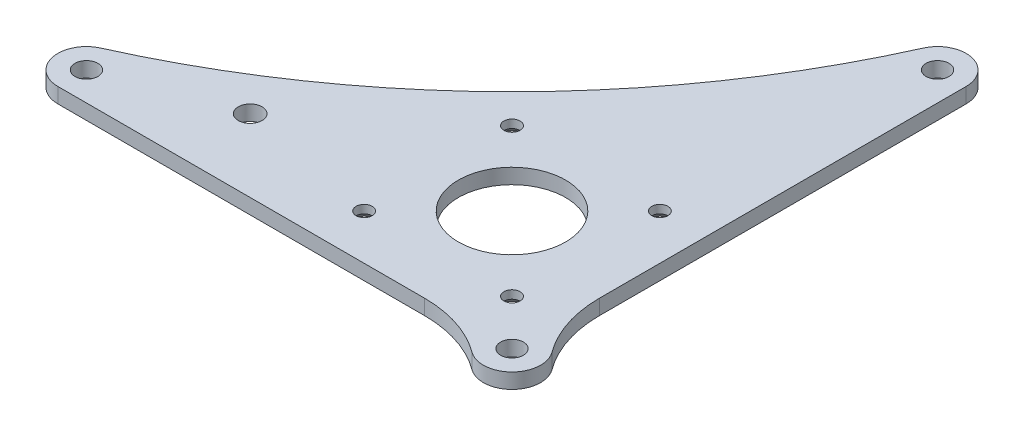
ISO-10303-21;
HEADER;
FILE_DESCRIPTION(('STEP AP214'),'2;1');
FILE_NAME('part.step','',(''),(''),'','','');
FILE_SCHEMA(('AUTOMOTIVE_DESIGN { 1 0 10303 214 1 1 1 1 }'));
ENDSEC;
DATA;
#1=APPLICATION_CONTEXT('core data for automotive mechanical design processes');
#2=APPLICATION_PROTOCOL_DEFINITION('international standard','automotive_design',2000,#1);
#3=PRODUCT_CONTEXT('',#1,'mechanical');
#4=PRODUCT('Part','Part','',(#3));
#5=PRODUCT_RELATED_PRODUCT_CATEGORY('part','',(#4));
#6=PRODUCT_DEFINITION_FORMATION('','',#4);
#7=PRODUCT_DEFINITION_CONTEXT('part definition',#1,'design');
#8=PRODUCT_DEFINITION('design','',#6,#7);
#9=PRODUCT_DEFINITION_SHAPE('','',#8);
#10=(LENGTH_UNIT() NAMED_UNIT(*) SI_UNIT(.MILLI.,.METRE.));
#11=(NAMED_UNIT(*) PLANE_ANGLE_UNIT() SI_UNIT($,.RADIAN.));
#12=(NAMED_UNIT(*) SI_UNIT($,.STERADIAN.) SOLID_ANGLE_UNIT());
#13=UNCERTAINTY_MEASURE_WITH_UNIT(LENGTH_MEASURE(1.E-05),#10,'distance_accuracy_value','');
#14=(GEOMETRIC_REPRESENTATION_CONTEXT(3) GLOBAL_UNCERTAINTY_ASSIGNED_CONTEXT((#13)) GLOBAL_UNIT_ASSIGNED_CONTEXT((#10,
#11,#12)) REPRESENTATION_CONTEXT('',''));
#15=CARTESIAN_POINT('',(0.,0.,0.));
#16=DIRECTION('',(0.,0.,1.));
#17=DIRECTION('',(1.,0.,0.));
#18=AXIS2_PLACEMENT_3D('',#15,#16,#17);
#19=CARTESIAN_POINT('',(-6.,0.,-95.25));
#20=DIRECTION('',(0.,-1.,0.));
#21=DIRECTION('',(0.,0.,-1.));
#22=AXIS2_PLACEMENT_3D('',#19,#20,#21);
#23=PLANE('',#22);
#24=CARTESIAN_POINT('',(-70.1317294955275,0.,-15.2236095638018));
#25=DIRECTION('',(0.,1.,0.));
#26=DIRECTION('',(0.,0.,1.));
#27=AXIS2_PLACEMENT_3D('',#24,#25,#26);
#28=CIRCLE('',#27,2.5);
#29=CARTESIAN_POINT('',(-70.1317294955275,0.,-12.7236095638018));
#30=VERTEX_POINT('',#29);
#31=EDGE_CURVE('E273',#30,#30,#28,.T.);
#32=ORIENTED_EDGE('',*,*,#31,.F.);
#33=EDGE_LOOP('',(#32));
#34=FACE_BOUND('',#33,.T.);
#35=CARTESIAN_POINT('',(-9.5,0.,-9.50000000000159));
#36=DIRECTION('',(0.,-1.,0.));
#37=DIRECTION('',(0.,0.,-1.));
#38=AXIS2_PLACEMENT_3D('',#35,#36,#37);
#39=CIRCLE('',#38,1.7);
#40=CARTESIAN_POINT('',(-9.5,0.,-11.2000000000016));
#41=VERTEX_POINT('',#40);
#42=EDGE_CURVE('E285',#41,#41,#39,.T.);
#43=ORIENTED_EDGE('',*,*,#42,.T.);
#44=EDGE_LOOP('',(#43));
#45=FACE_BOUND('',#44,.T.);
#46=CARTESIAN_POINT('',(-40.5,0.,-40.5000000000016));
#47=DIRECTION('',(0.,-1.,0.));
#48=DIRECTION('',(0.,0.,-1.));
#49=AXIS2_PLACEMENT_3D('',#46,#47,#48);
#50=CIRCLE('',#49,1.7);
#51=CARTESIAN_POINT('',(-40.5,0.,-42.2000000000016));
#52=VERTEX_POINT('',#51);
#53=EDGE_CURVE('E294',#52,#52,#50,.T.);
#54=ORIENTED_EDGE('',*,*,#53,.T.);
#55=EDGE_LOOP('',(#54));
#56=FACE_BOUND('',#55,.T.);
#57=CARTESIAN_POINT('',(-40.5,0.,-9.50000000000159));
#58=DIRECTION('',(0.,-1.,0.));
#59=DIRECTION('',(0.,0.,-1.));
#60=AXIS2_PLACEMENT_3D('',#57,#58,#59);
#61=CIRCLE('',#60,1.7);
#62=CARTESIAN_POINT('',(-40.5,0.,-11.2000000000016));
#63=VERTEX_POINT('',#62);
#64=EDGE_CURVE('E303',#63,#63,#61,.T.);
#65=ORIENTED_EDGE('',*,*,#64,.T.);
#66=EDGE_LOOP('',(#65));
#67=FACE_BOUND('',#66,.T.);
#68=CARTESIAN_POINT('',(-9.50000000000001,0.,-40.5000000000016));
#69=DIRECTION('',(0.,-1.,0.));
#70=DIRECTION('',(0.,0.,-1.));
#71=AXIS2_PLACEMENT_3D('',#68,#69,#70);
#72=CIRCLE('',#71,1.7);
#73=CARTESIAN_POINT('',(-9.50000000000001,0.,-42.2000000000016));
#74=VERTEX_POINT('',#73);
#75=EDGE_CURVE('E312',#74,#74,#72,.T.);
#76=ORIENTED_EDGE('',*,*,#75,.T.);
#77=EDGE_LOOP('',(#76));
#78=FACE_BOUND('',#77,.T.);
#79=CARTESIAN_POINT('',(-25.,0.,-25.0000000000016));
#80=DIRECTION('',(0.,1.,0.));
#81=DIRECTION('',(0.,0.,1.));
#82=AXIS2_PLACEMENT_3D('',#79,#80,#81);
#83=CIRCLE('',#82,11.25);
#84=CARTESIAN_POINT('',(-25.,0.,-13.7500000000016));
#85=VERTEX_POINT('',#84);
#86=EDGE_CURVE('E315',#85,#85,#83,.T.);
#87=ORIENTED_EDGE('',*,*,#86,.F.);
#88=EDGE_LOOP('',(#87));
#89=FACE_BOUND('',#88,.T.);
#90=CARTESIAN_POINT('',(-6.,0.,-95.25));
#91=DIRECTION('',(0.,1.,0.));
#92=DIRECTION('',(0.,0.,-1.));
#93=AXIS2_PLACEMENT_3D('',#90,#91,#92);
#94=CIRCLE('',#93,6.00000000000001);
#95=CARTESIAN_POINT('',(0.,0.,-95.25));
#96=VERTEX_POINT('',#95);
#97=CARTESIAN_POINT('',(-11.4745125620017,0.,-97.7055472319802));
#98=VERTEX_POINT('',#97);
#99=EDGE_CURVE('E145',#96,#98,#94,.T.);
#100=ORIENTED_EDGE('',*,*,#99,.T.);
#101=CARTESIAN_POINT('',(-167.843609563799,0.,-167.8436095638));
#102=DIRECTION('',(0.,-1.,0.));
#103=DIRECTION('',(0.,0.,1.));
#104=AXIS2_PLACEMENT_3D('',#101,#102,#103);
#105=CIRCLE('',#104,171.37865177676);
#106=CARTESIAN_POINT('',(-97.7055472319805,0.,-11.4745125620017));
#107=VERTEX_POINT('',#106);
#108=EDGE_CURVE('E148',#98,#107,#105,.T.);
#109=ORIENTED_EDGE('',*,*,#108,.T.);
#110=CARTESIAN_POINT('',(-95.2500000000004,0.,-5.99999999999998));
#111=DIRECTION('',(0.,1.,0.));
#112=DIRECTION('',(0.,0.,1.));
#113=AXIS2_PLACEMENT_3D('',#110,#111,#112);
#114=CIRCLE('',#113,6.00000000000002);
#115=CARTESIAN_POINT('',(-95.2500000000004,0.,0.));
#116=VERTEX_POINT('',#115);
#117=EDGE_CURVE('E152',#107,#116,#114,.T.);
#118=ORIENTED_EDGE('',*,*,#117,.T.);
#119=DIRECTION('',(1.,0.,0.));
#120=VECTOR('',#119,1.);
#121=CARTESIAN_POINT('',(-18.3303027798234,0.,0.));
#122=LINE('',#121,#120);
#123=CARTESIAN_POINT('',(-18.3303027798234,0.,0.));
#124=VERTEX_POINT('',#123);
#125=EDGE_CURVE('E155',#116,#124,#122,.T.);
#126=ORIENTED_EDGE('',*,*,#125,.T.);
#127=CARTESIAN_POINT('',(-18.3303027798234,0.,25.));
#128=DIRECTION('',(0.,-1.,0.));
#129=DIRECTION('',(0.,0.,1.));
#130=AXIS2_PLACEMENT_3D('',#127,#128,#129);
#131=CIRCLE('',#130,25.);
#132=CARTESIAN_POINT('',(-3.54780053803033,0.,4.83870967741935));
#133=VERTEX_POINT('',#132);
#134=EDGE_CURVE('E158',#124,#133,#131,.T.);
#135=ORIENTED_EDGE('',*,*,#134,.T.);
#136=CARTESIAN_POINT('',(0.,0.,0.));
#137=DIRECTION('',(0.,1.,0.));
#138=DIRECTION('',(0.,0.,1.));
#139=AXIS2_PLACEMENT_3D('',#136,#137,#138);
#140=CIRCLE('',#139,6.);
#141=CARTESIAN_POINT('',(4.83870967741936,0.,-3.54780053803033));
#142=VERTEX_POINT('',#141);
#143=EDGE_CURVE('E161',#133,#142,#140,.T.);
#144=ORIENTED_EDGE('',*,*,#143,.T.);
#145=CARTESIAN_POINT('',(25.,0.,-18.3303027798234));
#146=DIRECTION('',(0.,-1.,0.));
#147=DIRECTION('',(0.,0.,-1.));
#148=AXIS2_PLACEMENT_3D('',#145,#146,#147);
#149=CIRCLE('',#148,25.);
#150=CARTESIAN_POINT('',(0.,0.,-18.3303027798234));
#151=VERTEX_POINT('',#150);
#152=EDGE_CURVE('E122',#142,#151,#149,.T.);
#153=ORIENTED_EDGE('',*,*,#152,.T.);
#154=DIRECTION('',(0.,0.,-1.));
#155=VECTOR('',#154,1.);
#156=CARTESIAN_POINT('',(0.,0.,-18.3303027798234));
#157=LINE('',#156,#155);
#158=EDGE_CURVE('E164',#151,#96,#157,.T.);
#159=ORIENTED_EDGE('',*,*,#158,.T.);
#160=EDGE_LOOP('',(#100,#109,#118,#126,#135,#144,#153,#159));
#161=FACE_BOUND('',#160,.T.);
#162=CARTESIAN_POINT('',(0.,0.,0.));
#163=DIRECTION('',(0.,1.,0.));
#164=DIRECTION('',(0.,0.,1.));
#165=AXIS2_PLACEMENT_3D('',#162,#163,#164);
#166=CIRCLE('',#165,2.4);
#167=CARTESIAN_POINT('',(0.,0.,2.4));
#168=VERTEX_POINT('',#167);
#169=EDGE_CURVE('E267',#168,#168,#166,.T.);
#170=ORIENTED_EDGE('',*,*,#169,.F.);
#171=EDGE_LOOP('',(#170));
#172=FACE_BOUND('',#171,.T.);
#173=CARTESIAN_POINT('',(-6.,0.,-95.25));
#174=DIRECTION('',(0.,1.,0.));
#175=DIRECTION('',(0.,0.,1.));
#176=AXIS2_PLACEMENT_3D('',#173,#174,#175);
#177=CIRCLE('',#176,2.4);
#178=CARTESIAN_POINT('',(-6.,0.,-92.85));
#179=VERTEX_POINT('',#178);
#180=EDGE_CURVE('E258',#179,#179,#177,.T.);
#181=ORIENTED_EDGE('',*,*,#180,.F.);
#182=EDGE_LOOP('',(#181));
#183=FACE_BOUND('',#182,.T.);
#184=CARTESIAN_POINT('',(-95.2500000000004,0.,-5.99999999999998));
#185=DIRECTION('',(0.,1.,0.));
#186=DIRECTION('',(0.,0.,1.));
#187=AXIS2_PLACEMENT_3D('',#184,#185,#186);
#188=CIRCLE('',#187,2.4);
#189=CARTESIAN_POINT('',(-95.2500000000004,0.,-3.59999999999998));
#190=VERTEX_POINT('',#189);
#191=EDGE_CURVE('E254',#190,#190,#188,.T.);
#192=ORIENTED_EDGE('',*,*,#191,.F.);
#193=EDGE_LOOP('',(#192));
#194=FACE_BOUND('',#193,.T.);
#195=ADVANCED_FACE('F47',(#34,#45,#56,#67,#78,#89,#161,#172,#183,#194),#23,.F.);
#196=CARTESIAN_POINT('',(-6.,-3.175,-95.25));
#197=DIRECTION('',(0.,1.,0.));
#198=DIRECTION('',(0.,0.,1.));
#199=AXIS2_PLACEMENT_3D('',#196,#197,#198);
#200=CYLINDRICAL_SURFACE('',#199,6.00000000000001);
#201=ORIENTED_EDGE('',*,*,#99,.F.);
#202=DIRECTION('',(0.,1.,0.));
#203=VECTOR('',#202,1.);
#204=CARTESIAN_POINT('',(0.,-3.175,-95.25));
#205=LINE('',#204,#203);
#206=CARTESIAN_POINT('',(0.,-3.175,-95.25));
#207=VERTEX_POINT('',#206);
#208=EDGE_CURVE('E11',#207,#96,#205,.T.);
#209=ORIENTED_EDGE('',*,*,#208,.F.);
#210=CARTESIAN_POINT('',(-6.,-3.175,-95.25));
#211=DIRECTION('',(0.,1.,0.));
#212=DIRECTION('',(0.,0.,-1.));
#213=AXIS2_PLACEMENT_3D('',#210,#211,#212);
#214=CIRCLE('',#213,6.00000000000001);
#215=CARTESIAN_POINT('',(-11.4745125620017,-3.175,-97.7055472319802));
#216=VERTEX_POINT('',#215);
#217=EDGE_CURVE('E166',#207,#216,#214,.T.);
#218=ORIENTED_EDGE('',*,*,#217,.T.);
#219=DIRECTION('',(0.,1.,0.));
#220=VECTOR('',#219,1.);
#221=CARTESIAN_POINT('',(-11.4745125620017,-3.175,-97.7055472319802));
#222=LINE('',#221,#220);
#223=EDGE_CURVE('E51',#216,#98,#222,.T.);
#224=ORIENTED_EDGE('',*,*,#223,.T.);
#225=EDGE_LOOP('',(#201,#209,#218,#224));
#226=FACE_BOUND('',#225,.T.);
#227=ADVANCED_FACE('F49',(#226),#200,.T.);
#228=CARTESIAN_POINT('',(0.,-3.175,-18.3303027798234));
#229=DIRECTION('',(1.,0.,0.));
#230=DIRECTION('',(0.,0.,-1.));
#231=AXIS2_PLACEMENT_3D('',#228,#229,#230);
#232=PLANE('',#231);
#233=ORIENTED_EDGE('',*,*,#158,.F.);
#234=DIRECTION('',(0.,1.,0.));
#235=VECTOR('',#234,1.);
#236=CARTESIAN_POINT('',(0.,-3.175,-18.3303027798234));
#237=LINE('',#236,#235);
#238=CARTESIAN_POINT('',(0.,-3.175,-18.3303027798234));
#239=VERTEX_POINT('',#238);
#240=EDGE_CURVE('E57',#239,#151,#237,.T.);
#241=ORIENTED_EDGE('',*,*,#240,.F.);
#242=DIRECTION('',(0.,0.,-1.));
#243=VECTOR('',#242,1.);
#244=CARTESIAN_POINT('',(0.,-3.175,-18.3303027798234));
#245=LINE('',#244,#243);
#246=EDGE_CURVE('E135',#239,#207,#245,.T.);
#247=ORIENTED_EDGE('',*,*,#246,.T.);
#248=ORIENTED_EDGE('',*,*,#208,.T.);
#249=EDGE_LOOP('',(#233,#241,#247,#248));
#250=FACE_BOUND('',#249,.T.);
#251=ADVANCED_FACE('F178',(#250),#232,.T.);
#252=CARTESIAN_POINT('',(25.,-3.175,-18.3303027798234));
#253=DIRECTION('',(0.,1.,0.));
#254=DIRECTION('',(0.,0.,1.));
#255=AXIS2_PLACEMENT_3D('',#252,#253,#254);
#256=CYLINDRICAL_SURFACE('',#255,25.);
#257=ORIENTED_EDGE('',*,*,#152,.F.);
#258=DIRECTION('',(0.,1.,0.));
#259=VECTOR('',#258,1.);
#260=CARTESIAN_POINT('',(4.83870967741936,-3.175,-3.54780053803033));
#261=LINE('',#260,#259);
#262=CARTESIAN_POINT('',(4.83870967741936,-3.175,-3.54780053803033));
#263=VERTEX_POINT('',#262);
#264=EDGE_CURVE('E117',#263,#142,#261,.T.);
#265=ORIENTED_EDGE('',*,*,#264,.F.);
#266=CARTESIAN_POINT('',(25.,-3.175,-18.3303027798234));
#267=DIRECTION('',(0.,-1.,0.));
#268=DIRECTION('',(0.,0.,-1.));
#269=AXIS2_PLACEMENT_3D('',#266,#267,#268);
#270=CIRCLE('',#269,25.);
#271=EDGE_CURVE('E120',#263,#239,#270,.T.);
#272=ORIENTED_EDGE('',*,*,#271,.T.);
#273=ORIENTED_EDGE('',*,*,#240,.T.);
#274=EDGE_LOOP('',(#257,#265,#272,#273));
#275=FACE_BOUND('',#274,.T.);
#276=ADVANCED_FACE('F119',(#275),#256,.F.);
#277=CARTESIAN_POINT('',(0.,-3.175,0.));
#278=DIRECTION('',(0.,1.,0.));
#279=DIRECTION('',(0.,0.,1.));
#280=AXIS2_PLACEMENT_3D('',#277,#278,#279);
#281=CYLINDRICAL_SURFACE('',#280,6.);
#282=ORIENTED_EDGE('',*,*,#143,.F.);
#283=DIRECTION('',(0.,1.,0.));
#284=VECTOR('',#283,1.);
#285=CARTESIAN_POINT('',(-3.54780053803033,-3.175,4.83870967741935));
#286=LINE('',#285,#284);
#287=CARTESIAN_POINT('',(-3.54780053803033,-3.175,4.83870967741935));
#288=VERTEX_POINT('',#287);
#289=EDGE_CURVE('E127',#288,#133,#286,.T.);
#290=ORIENTED_EDGE('',*,*,#289,.F.);
#291=CARTESIAN_POINT('',(0.,-3.175,0.));
#292=DIRECTION('',(0.,1.,0.));
#293=DIRECTION('',(0.,0.,1.));
#294=AXIS2_PLACEMENT_3D('',#291,#292,#293);
#295=CIRCLE('',#294,6.);
#296=EDGE_CURVE('E133',#288,#263,#295,.T.);
#297=ORIENTED_EDGE('',*,*,#296,.T.);
#298=ORIENTED_EDGE('',*,*,#264,.T.);
#299=EDGE_LOOP('',(#282,#290,#297,#298));
#300=FACE_BOUND('',#299,.T.);
#301=ADVANCED_FACE('F137',(#300),#281,.T.);
#302=CARTESIAN_POINT('',(-18.3303027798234,-3.175,25.));
#303=DIRECTION('',(0.,1.,0.));
#304=DIRECTION('',(0.,0.,1.));
#305=AXIS2_PLACEMENT_3D('',#302,#303,#304);
#306=CYLINDRICAL_SURFACE('',#305,25.);
#307=ORIENTED_EDGE('',*,*,#134,.F.);
#308=DIRECTION('',(0.,1.,0.));
#309=VECTOR('',#308,1.);
#310=CARTESIAN_POINT('',(-18.3303027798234,-3.175,0.));
#311=LINE('',#310,#309);
#312=CARTESIAN_POINT('',(-18.3303027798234,-3.175,0.));
#313=VERTEX_POINT('',#312);
#314=EDGE_CURVE('E170',#313,#124,#311,.T.);
#315=ORIENTED_EDGE('',*,*,#314,.F.);
#316=CARTESIAN_POINT('',(-18.3303027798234,-3.175,25.));
#317=DIRECTION('',(0.,-1.,0.));
#318=DIRECTION('',(0.,0.,1.));
#319=AXIS2_PLACEMENT_3D('',#316,#317,#318);
#320=CIRCLE('',#319,25.);
#321=EDGE_CURVE('E138',#313,#288,#320,.T.);
#322=ORIENTED_EDGE('',*,*,#321,.T.);
#323=ORIENTED_EDGE('',*,*,#289,.T.);
#324=EDGE_LOOP('',(#307,#315,#322,#323));
#325=FACE_BOUND('',#324,.T.);
#326=ADVANCED_FACE('F335',(#325),#306,.F.);
#327=CARTESIAN_POINT('',(-18.3303027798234,-3.175,0.));
#328=DIRECTION('',(0.,0.,1.));
#329=DIRECTION('',(1.,0.,0.));
#330=AXIS2_PLACEMENT_3D('',#327,#328,#329);
#331=PLANE('',#330);
#332=ORIENTED_EDGE('',*,*,#125,.F.);
#333=DIRECTION('',(0.,1.,0.));
#334=VECTOR('',#333,1.);
#335=CARTESIAN_POINT('',(-95.2500000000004,-3.175,0.));
#336=LINE('',#335,#334);
#337=CARTESIAN_POINT('',(-95.2500000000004,-3.175,0.));
#338=VERTEX_POINT('',#337);
#339=EDGE_CURVE('E172',#338,#116,#336,.T.);
#340=ORIENTED_EDGE('',*,*,#339,.F.);
#341=DIRECTION('',(1.,0.,0.));
#342=VECTOR('',#341,1.);
#343=CARTESIAN_POINT('',(-18.3303027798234,-3.175,0.));
#344=LINE('',#343,#342);
#345=EDGE_CURVE('E140',#338,#313,#344,.T.);
#346=ORIENTED_EDGE('',*,*,#345,.T.);
#347=ORIENTED_EDGE('',*,*,#314,.T.);
#348=EDGE_LOOP('',(#332,#340,#346,#347));
#349=FACE_BOUND('',#348,.T.);
#350=ADVANCED_FACE('F329',(#349),#331,.T.);
#351=CARTESIAN_POINT('',(-95.2500000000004,-3.175,-5.99999999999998));
#352=DIRECTION('',(0.,1.,0.));
#353=DIRECTION('',(0.,0.,1.));
#354=AXIS2_PLACEMENT_3D('',#351,#352,#353);
#355=CYLINDRICAL_SURFACE('',#354,6.00000000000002);
#356=ORIENTED_EDGE('',*,*,#117,.F.);
#357=DIRECTION('',(0.,1.,0.));
#358=VECTOR('',#357,1.);
#359=CARTESIAN_POINT('',(-97.7055472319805,-3.175,-11.4745125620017));
#360=LINE('',#359,#358);
#361=CARTESIAN_POINT('',(-97.7055472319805,-3.175,-11.4745125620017));
#362=VERTEX_POINT('',#361);
#363=EDGE_CURVE('E173',#362,#107,#360,.T.);
#364=ORIENTED_EDGE('',*,*,#363,.F.);
#365=CARTESIAN_POINT('',(-95.2500000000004,-3.175,-5.99999999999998));
#366=DIRECTION('',(0.,1.,0.));
#367=DIRECTION('',(0.,0.,1.));
#368=AXIS2_PLACEMENT_3D('',#365,#366,#367);
#369=CIRCLE('',#368,6.00000000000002);
#370=EDGE_CURVE('E323',#362,#338,#369,.T.);
#371=ORIENTED_EDGE('',*,*,#370,.T.);
#372=ORIENTED_EDGE('',*,*,#339,.T.);
#373=EDGE_LOOP('',(#356,#364,#371,#372));
#374=FACE_BOUND('',#373,.T.);
#375=ADVANCED_FACE('F333',(#374),#355,.T.);
#376=CARTESIAN_POINT('',(-167.843609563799,-3.175,-167.8436095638));
#377=DIRECTION('',(0.,1.,0.));
#378=DIRECTION('',(0.,0.,1.));
#379=AXIS2_PLACEMENT_3D('',#376,#377,#378);
#380=CYLINDRICAL_SURFACE('',#379,171.37865177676);
#381=ORIENTED_EDGE('',*,*,#108,.F.);
#382=ORIENTED_EDGE('',*,*,#223,.F.);
#383=CARTESIAN_POINT('',(-167.843609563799,-3.175,-167.8436095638));
#384=DIRECTION('',(0.,-1.,0.));
#385=DIRECTION('',(0.,0.,1.));
#386=AXIS2_PLACEMENT_3D('',#383,#384,#385);
#387=CIRCLE('',#386,171.37865177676);
#388=EDGE_CURVE('E321',#216,#362,#387,.T.);
#389=ORIENTED_EDGE('',*,*,#388,.T.);
#390=ORIENTED_EDGE('',*,*,#363,.T.);
#391=EDGE_LOOP('',(#381,#382,#389,#390));
#392=FACE_BOUND('',#391,.T.);
#393=ADVANCED_FACE('F175',(#392),#380,.F.);
#394=CARTESIAN_POINT('',(-6.,-3.175,-95.25));
#395=DIRECTION('',(0.,-1.,0.));
#396=DIRECTION('',(0.,0.,-1.));
#397=AXIS2_PLACEMENT_3D('',#394,#395,#396);
#398=PLANE('',#397);
#399=CARTESIAN_POINT('',(-95.2500000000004,-3.175,-5.99999999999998));
#400=DIRECTION('',(0.,-1.,0.));
#401=DIRECTION('',(0.,0.,-1.));
#402=AXIS2_PLACEMENT_3D('',#399,#400,#401);
#403=CIRCLE('',#402,2.4);
#404=CARTESIAN_POINT('',(-95.2500000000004,-3.175,-8.39999999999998));
#405=VERTEX_POINT('',#404);
#406=EDGE_CURVE('E257',#405,#405,#403,.T.);
#407=ORIENTED_EDGE('',*,*,#406,.F.);
#408=EDGE_LOOP('',(#407));
#409=FACE_BOUND('',#408,.T.);
#410=CARTESIAN_POINT('',(-6.,-3.175,-95.25));
#411=DIRECTION('',(0.,-1.,0.));
#412=DIRECTION('',(0.,0.,-1.));
#413=AXIS2_PLACEMENT_3D('',#410,#411,#412);
#414=CIRCLE('',#413,2.4);
#415=CARTESIAN_POINT('',(-6.,-3.175,-97.65));
#416=VERTEX_POINT('',#415);
#417=EDGE_CURVE('E261',#416,#416,#414,.T.);
#418=ORIENTED_EDGE('',*,*,#417,.F.);
#419=EDGE_LOOP('',(#418));
#420=FACE_BOUND('',#419,.T.);
#421=CARTESIAN_POINT('',(0.,-3.175,0.));
#422=DIRECTION('',(0.,-1.,0.));
#423=DIRECTION('',(0.,0.,-1.));
#424=AXIS2_PLACEMENT_3D('',#421,#422,#423);
#425=CIRCLE('',#424,2.4);
#426=CARTESIAN_POINT('',(0.,-3.175,-2.4));
#427=VERTEX_POINT('',#426);
#428=EDGE_CURVE('E270',#427,#427,#425,.T.);
#429=ORIENTED_EDGE('',*,*,#428,.F.);
#430=EDGE_LOOP('',(#429));
#431=FACE_BOUND('',#430,.T.);
#432=CARTESIAN_POINT('',(-70.1317294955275,-3.175,-15.2236095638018));
#433=DIRECTION('',(0.,-1.,0.));
#434=DIRECTION('',(0.,0.,-1.));
#435=AXIS2_PLACEMENT_3D('',#432,#433,#434);
#436=CIRCLE('',#435,2.5);
#437=CARTESIAN_POINT('',(-70.1317294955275,-3.175,-17.7236095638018));
#438=VERTEX_POINT('',#437);
#439=EDGE_CURVE('E276',#438,#438,#436,.T.);
#440=ORIENTED_EDGE('',*,*,#439,.F.);
#441=EDGE_LOOP('',(#440));
#442=FACE_BOUND('',#441,.T.);
#443=CARTESIAN_POINT('',(-9.5,-3.175,-9.50000000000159));
#444=DIRECTION('',(0.,-1.,0.));
#445=DIRECTION('',(0.,0.,-1.));
#446=AXIS2_PLACEMENT_3D('',#443,#444,#445);
#447=CIRCLE('',#446,3.15);
#448=CARTESIAN_POINT('',(-9.5,-3.175,-12.6500000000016));
#449=VERTEX_POINT('',#448);
#450=EDGE_CURVE('E279',#449,#449,#447,.T.);
#451=ORIENTED_EDGE('',*,*,#450,.F.);
#452=EDGE_LOOP('',(#451));
#453=FACE_BOUND('',#452,.T.);
#454=CARTESIAN_POINT('',(-40.5,-3.175,-40.5000000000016));
#455=DIRECTION('',(0.,-1.,0.));
#456=DIRECTION('',(0.,0.,-1.));
#457=AXIS2_PLACEMENT_3D('',#454,#455,#456);
#458=CIRCLE('',#457,3.15);
#459=CARTESIAN_POINT('',(-40.5,-3.175,-43.6500000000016));
#460=VERTEX_POINT('',#459);
#461=EDGE_CURVE('E288',#460,#460,#458,.T.);
#462=ORIENTED_EDGE('',*,*,#461,.F.);
#463=EDGE_LOOP('',(#462));
#464=FACE_BOUND('',#463,.T.);
#465=CARTESIAN_POINT('',(-40.5,-3.175,-9.50000000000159));
#466=DIRECTION('',(0.,-1.,0.));
#467=DIRECTION('',(0.,0.,-1.));
#468=AXIS2_PLACEMENT_3D('',#465,#466,#467);
#469=CIRCLE('',#468,3.15);
#470=CARTESIAN_POINT('',(-40.5,-3.175,-12.6500000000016));
#471=VERTEX_POINT('',#470);
#472=EDGE_CURVE('E297',#471,#471,#469,.T.);
#473=ORIENTED_EDGE('',*,*,#472,.F.);
#474=EDGE_LOOP('',(#473));
#475=FACE_BOUND('',#474,.T.);
#476=CARTESIAN_POINT('',(-9.50000000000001,-3.175,-40.5000000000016));
#477=DIRECTION('',(0.,-1.,0.));
#478=DIRECTION('',(0.,0.,-1.));
#479=AXIS2_PLACEMENT_3D('',#476,#477,#478);
#480=CIRCLE('',#479,3.15);
#481=CARTESIAN_POINT('',(-9.50000000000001,-3.175,-43.6500000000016));
#482=VERTEX_POINT('',#481);
#483=EDGE_CURVE('E306',#482,#482,#480,.T.);
#484=ORIENTED_EDGE('',*,*,#483,.F.);
#485=EDGE_LOOP('',(#484));
#486=FACE_BOUND('',#485,.T.);
#487=CARTESIAN_POINT('',(-25.,-3.175,-25.0000000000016));
#488=DIRECTION('',(0.,1.,0.));
#489=DIRECTION('',(0.,0.,1.));
#490=AXIS2_PLACEMENT_3D('',#487,#488,#489);
#491=CIRCLE('',#490,11.25);
#492=CARTESIAN_POINT('',(-25.,-3.175,-13.7500000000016));
#493=VERTEX_POINT('',#492);
#494=EDGE_CURVE('E149',#493,#493,#491,.T.);
#495=ORIENTED_EDGE('',*,*,#494,.T.);
#496=EDGE_LOOP('',(#495));
#497=FACE_BOUND('',#496,.T.);
#498=ORIENTED_EDGE('',*,*,#217,.F.);
#499=ORIENTED_EDGE('',*,*,#246,.F.);
#500=ORIENTED_EDGE('',*,*,#271,.F.);
#501=ORIENTED_EDGE('',*,*,#296,.F.);
#502=ORIENTED_EDGE('',*,*,#321,.F.);
#503=ORIENTED_EDGE('',*,*,#345,.F.);
#504=ORIENTED_EDGE('',*,*,#370,.F.);
#505=ORIENTED_EDGE('',*,*,#388,.F.);
#506=EDGE_LOOP('',(#498,#499,#500,#501,#502,#503,#504,#505));
#507=FACE_BOUND('',#506,.T.);
#508=ADVANCED_FACE('F131',(#409,#420,#431,#442,#453,#464,#475,#486,#497,#507),#398,.T.);
#509=CARTESIAN_POINT('',(-25.,-3.175,-25.0000000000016));
#510=DIRECTION('',(0.,1.,0.));
#511=DIRECTION('',(0.,0.,1.));
#512=AXIS2_PLACEMENT_3D('',#509,#510,#511);
#513=CYLINDRICAL_SURFACE('',#512,11.25);
#514=ORIENTED_EDGE('',*,*,#494,.F.);
#515=EDGE_LOOP('',(#514));
#516=FACE_BOUND('',#515,.T.);
#517=ORIENTED_EDGE('',*,*,#86,.T.);
#518=EDGE_LOOP('',(#517));
#519=FACE_BOUND('',#518,.T.);
#520=ADVANCED_FACE('F197',(#516,#519),#513,.F.);
#521=CARTESIAN_POINT('',(-9.50000000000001,-3.175,-40.5000000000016));
#522=DIRECTION('',(0.,-1.,0.));
#523=DIRECTION('',(0.,0.,-1.));
#524=AXIS2_PLACEMENT_3D('',#521,#522,#523);
#525=CYLINDRICAL_SURFACE('',#524,1.7);
#526=ORIENTED_EDGE('',*,*,#75,.F.);
#527=EDGE_LOOP('',(#526));
#528=FACE_BOUND('',#527,.T.);
#529=CARTESIAN_POINT('',(-9.50000000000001,-1.725,-40.5000000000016));
#530=DIRECTION('',(0.,-1.,0.));
#531=DIRECTION('',(0.,0.,-1.));
#532=AXIS2_PLACEMENT_3D('',#529,#530,#531);
#533=CIRCLE('',#532,1.7);
#534=CARTESIAN_POINT('',(-9.50000000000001,-1.725,-42.2000000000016));
#535=VERTEX_POINT('',#534);
#536=EDGE_CURVE('E309',#535,#535,#533,.T.);
#537=ORIENTED_EDGE('',*,*,#536,.T.);
#538=EDGE_LOOP('',(#537));
#539=FACE_BOUND('',#538,.T.);
#540=ADVANCED_FACE('F201',(#528,#539),#525,.F.);
#541=CARTESIAN_POINT('',(-9.50000000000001,-3.175,-40.5000000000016));
#542=DIRECTION('',(0.,-1.,0.));
#543=DIRECTION('',(0.,0.,-1.));
#544=AXIS2_PLACEMENT_3D('',#541,#542,#543);
#545=CONICAL_SURFACE('',#544,3.15,0.785398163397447);
#546=ORIENTED_EDGE('',*,*,#536,.F.);
#547=EDGE_LOOP('',(#546));
#548=FACE_BOUND('',#547,.T.);
#549=ORIENTED_EDGE('',*,*,#483,.T.);
#550=EDGE_LOOP('',(#549));
#551=FACE_BOUND('',#550,.T.);
#552=ADVANCED_FACE('F205',(#548,#551),#545,.F.);
#553=CARTESIAN_POINT('',(-40.5,-3.175,-9.50000000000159));
#554=DIRECTION('',(0.,-1.,0.));
#555=DIRECTION('',(0.,0.,-1.));
#556=AXIS2_PLACEMENT_3D('',#553,#554,#555);
#557=CYLINDRICAL_SURFACE('',#556,1.7);
#558=ORIENTED_EDGE('',*,*,#64,.F.);
#559=EDGE_LOOP('',(#558));
#560=FACE_BOUND('',#559,.T.);
#561=CARTESIAN_POINT('',(-40.5,-1.725,-9.50000000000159));
#562=DIRECTION('',(0.,-1.,0.));
#563=DIRECTION('',(0.,0.,-1.));
#564=AXIS2_PLACEMENT_3D('',#561,#562,#563);
#565=CIRCLE('',#564,1.7);
#566=CARTESIAN_POINT('',(-40.5,-1.725,-11.2000000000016));
#567=VERTEX_POINT('',#566);
#568=EDGE_CURVE('E300',#567,#567,#565,.T.);
#569=ORIENTED_EDGE('',*,*,#568,.T.);
#570=EDGE_LOOP('',(#569));
#571=FACE_BOUND('',#570,.T.);
#572=ADVANCED_FACE('F209',(#560,#571),#557,.F.);
#573=CARTESIAN_POINT('',(-40.5,-3.175,-9.50000000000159));
#574=DIRECTION('',(0.,-1.,0.));
#575=DIRECTION('',(0.,0.,-1.));
#576=AXIS2_PLACEMENT_3D('',#573,#574,#575);
#577=CONICAL_SURFACE('',#576,3.15,0.785398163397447);
#578=ORIENTED_EDGE('',*,*,#568,.F.);
#579=EDGE_LOOP('',(#578));
#580=FACE_BOUND('',#579,.T.);
#581=ORIENTED_EDGE('',*,*,#472,.T.);
#582=EDGE_LOOP('',(#581));
#583=FACE_BOUND('',#582,.T.);
#584=ADVANCED_FACE('F213',(#580,#583),#577,.F.);
#585=CARTESIAN_POINT('',(-40.5,-3.175,-40.5000000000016));
#586=DIRECTION('',(0.,-1.,0.));
#587=DIRECTION('',(0.,0.,-1.));
#588=AXIS2_PLACEMENT_3D('',#585,#586,#587);
#589=CYLINDRICAL_SURFACE('',#588,1.7);
#590=ORIENTED_EDGE('',*,*,#53,.F.);
#591=EDGE_LOOP('',(#590));
#592=FACE_BOUND('',#591,.T.);
#593=CARTESIAN_POINT('',(-40.5,-1.725,-40.5000000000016));
#594=DIRECTION('',(0.,-1.,0.));
#595=DIRECTION('',(0.,0.,-1.));
#596=AXIS2_PLACEMENT_3D('',#593,#594,#595);
#597=CIRCLE('',#596,1.7);
#598=CARTESIAN_POINT('',(-40.5,-1.725,-42.2000000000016));
#599=VERTEX_POINT('',#598);
#600=EDGE_CURVE('E291',#599,#599,#597,.T.);
#601=ORIENTED_EDGE('',*,*,#600,.T.);
#602=EDGE_LOOP('',(#601));
#603=FACE_BOUND('',#602,.T.);
#604=ADVANCED_FACE('F217',(#592,#603),#589,.F.);
#605=CARTESIAN_POINT('',(-40.5,-3.175,-40.5000000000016));
#606=DIRECTION('',(0.,-1.,0.));
#607=DIRECTION('',(0.,0.,-1.));
#608=AXIS2_PLACEMENT_3D('',#605,#606,#607);
#609=CONICAL_SURFACE('',#608,3.15,0.785398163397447);
#610=ORIENTED_EDGE('',*,*,#600,.F.);
#611=EDGE_LOOP('',(#610));
#612=FACE_BOUND('',#611,.T.);
#613=ORIENTED_EDGE('',*,*,#461,.T.);
#614=EDGE_LOOP('',(#613));
#615=FACE_BOUND('',#614,.T.);
#616=ADVANCED_FACE('F221',(#612,#615),#609,.F.);
#617=CARTESIAN_POINT('',(-9.5,-3.175,-9.50000000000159));
#618=DIRECTION('',(0.,-1.,0.));
#619=DIRECTION('',(0.,0.,-1.));
#620=AXIS2_PLACEMENT_3D('',#617,#618,#619);
#621=CYLINDRICAL_SURFACE('',#620,1.7);
#622=ORIENTED_EDGE('',*,*,#42,.F.);
#623=EDGE_LOOP('',(#622));
#624=FACE_BOUND('',#623,.T.);
#625=CARTESIAN_POINT('',(-9.5,-1.725,-9.50000000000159));
#626=DIRECTION('',(0.,-1.,0.));
#627=DIRECTION('',(0.,0.,-1.));
#628=AXIS2_PLACEMENT_3D('',#625,#626,#627);
#629=CIRCLE('',#628,1.7);
#630=CARTESIAN_POINT('',(-9.5,-1.725,-11.2000000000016));
#631=VERTEX_POINT('',#630);
#632=EDGE_CURVE('E282',#631,#631,#629,.T.);
#633=ORIENTED_EDGE('',*,*,#632,.T.);
#634=EDGE_LOOP('',(#633));
#635=FACE_BOUND('',#634,.T.);
#636=ADVANCED_FACE('F225',(#624,#635),#621,.F.);
#637=CARTESIAN_POINT('',(-9.5,-3.175,-9.50000000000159));
#638=DIRECTION('',(0.,-1.,0.));
#639=DIRECTION('',(0.,0.,-1.));
#640=AXIS2_PLACEMENT_3D('',#637,#638,#639);
#641=CONICAL_SURFACE('',#640,3.15,0.785398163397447);
#642=ORIENTED_EDGE('',*,*,#632,.F.);
#643=EDGE_LOOP('',(#642));
#644=FACE_BOUND('',#643,.T.);
#645=ORIENTED_EDGE('',*,*,#450,.T.);
#646=EDGE_LOOP('',(#645));
#647=FACE_BOUND('',#646,.T.);
#648=ADVANCED_FACE('F229',(#644,#647),#641,.F.);
#649=CARTESIAN_POINT('',(-70.1317294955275,0.,-15.2236095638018));
#650=DIRECTION('',(0.,1.,0.));
#651=DIRECTION('',(0.,0.,1.));
#652=AXIS2_PLACEMENT_3D('',#649,#650,#651);
#653=CYLINDRICAL_SURFACE('',#652,2.5);
#654=ORIENTED_EDGE('',*,*,#31,.T.);
#655=EDGE_LOOP('',(#654));
#656=FACE_BOUND('',#655,.T.);
#657=ORIENTED_EDGE('',*,*,#439,.T.);
#658=EDGE_LOOP('',(#657));
#659=FACE_BOUND('',#658,.T.);
#660=ADVANCED_FACE('F233',(#656,#659),#653,.F.);
#661=CARTESIAN_POINT('',(0.,0.,0.));
#662=DIRECTION('',(0.,1.,0.));
#663=DIRECTION('',(0.,0.,1.));
#664=AXIS2_PLACEMENT_3D('',#661,#662,#663);
#665=CYLINDRICAL_SURFACE('',#664,2.4);
#666=ORIENTED_EDGE('',*,*,#169,.T.);
#667=EDGE_LOOP('',(#666));
#668=FACE_BOUND('',#667,.T.);
#669=ORIENTED_EDGE('',*,*,#428,.T.);
#670=EDGE_LOOP('',(#669));
#671=FACE_BOUND('',#670,.T.);
#672=ADVANCED_FACE('F237',(#668,#671),#665,.F.);
#673=CARTESIAN_POINT('',(-6.,0.,-95.25));
#674=DIRECTION('',(0.,1.,0.));
#675=DIRECTION('',(0.,0.,1.));
#676=AXIS2_PLACEMENT_3D('',#673,#674,#675);
#677=CYLINDRICAL_SURFACE('',#676,2.4);
#678=ORIENTED_EDGE('',*,*,#180,.T.);
#679=EDGE_LOOP('',(#678));
#680=FACE_BOUND('',#679,.T.);
#681=ORIENTED_EDGE('',*,*,#417,.T.);
#682=EDGE_LOOP('',(#681));
#683=FACE_BOUND('',#682,.T.);
#684=ADVANCED_FACE('F241',(#680,#683),#677,.F.);
#685=CARTESIAN_POINT('',(-95.2500000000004,0.,-5.99999999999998));
#686=DIRECTION('',(0.,1.,0.));
#687=DIRECTION('',(0.,0.,1.));
#688=AXIS2_PLACEMENT_3D('',#685,#686,#687);
#689=CYLINDRICAL_SURFACE('',#688,2.4);
#690=ORIENTED_EDGE('',*,*,#191,.T.);
#691=EDGE_LOOP('',(#690));
#692=FACE_BOUND('',#691,.T.);
#693=ORIENTED_EDGE('',*,*,#406,.T.);
#694=EDGE_LOOP('',(#693));
#695=FACE_BOUND('',#694,.T.);
#696=ADVANCED_FACE('F245',(#692,#695),#689,.F.);
#697=CLOSED_SHELL('',(#195,#227,#251,#276,#301,#326,#350,#375,#393,#508,#520,#540,#552,#572,
#584,#604,#616,#636,#648,#660,#672,#684,#696));
#698=MANIFOLD_SOLID_BREP('B2',#697);
#699=ADVANCED_BREP_SHAPE_REPRESENTATION('',(#18,#698),#14);
#700=SHAPE_DEFINITION_REPRESENTATION(#9,#699);
ENDSEC;
END-ISO-10303-21;
